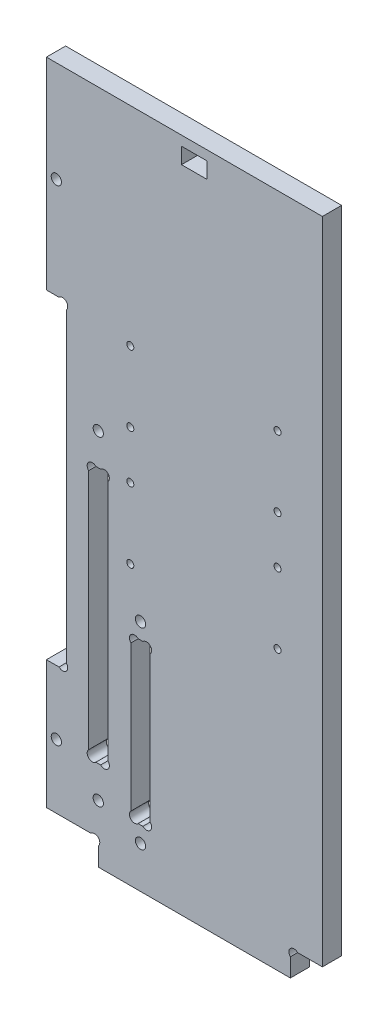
from build123d import *

# Parameters (mm, degrees)
ESQUISSE1_R      = 1.6
ESQUISSE1_R_2    = 1.1
ESQUISSE1_W      = 8
ESQUISSE1_H      = 5
EXTRUSION1_DEPTH = 6


with BuildPart() as part:
    # Esquisse1 → Extrusion1 (new body)
    with BuildSketch(Plane.XY):
        with BuildLine():
            Line((3.9372583, 50), (0, 50))
            Line((0, 50), (0, 10))
            Line((0, 10), (13.9372583, 10))
            ThreePointArc((13.9372583, 10), (16.2, 10), (16.2, 7.7372583))
            Line((16.2, 7.7372583), (16.2, 2))
            Line((16.2, 2), (76.2, 2))
            Line((76.2, 2), (76.2, 7.7372583))
            ThreePointArc((76.2, 7.7372583), (76.2, 10), (78.4627417, 10))
            Line((78.4627417, 10), (86.2, 10))
            Line((86.2, 10), (86.2, 213))
            Line((86.2, 213), (0, 213))
            Line((0, 213), (0, 150))
            Line((0, 150), (3.9372583, 150))
            ThreePointArc((3.9372583, 150), (6.2, 150), (6.2, 147.7372583))
            Line((6.2, 147.7372583), (6.2, 52.2627417))
            ThreePointArc((6.2, 52.2627417), (6.2, 50), (3.9372583, 50))
        make_face()
        with Locations((3.1, 30)):
            Circle(ESQUISSE1_R, mode=Mode.SUBTRACT)
        with Locations((3.1, 181.5)):
            Circle(ESQUISSE1_R, mode=Mode.SUBTRACT)
        with Locations((29.4, 15)):
            Circle(ESQUISSE1_R, mode=Mode.SUBTRACT)
        with Locations((16.2, 20)):
            Circle(ESQUISSE1_R, mode=Mode.SUBTRACT)
        with Locations(Location((29.4, 75, 0), (0, 0, 180))):
            Circle(ESQUISSE1_R, mode=Mode.SUBTRACT)
        with Locations(Location((16.2, 120, 0), (0, 0, 180))):
            Circle(ESQUISSE1_R, mode=Mode.SUBTRACT)
        with Locations((72.2, 148)):
            Circle(ESQUISSE1_R_2, mode=Mode.SUBTRACT)
        with Locations((72.2, 126)):
            Circle(ESQUISSE1_R_2, mode=Mode.SUBTRACT)
        with Locations((72.2, 111)):
            Circle(ESQUISSE1_R_2, mode=Mode.SUBTRACT)
        with Locations((72.2, 89)):
            Circle(ESQUISSE1_R_2, mode=Mode.SUBTRACT)
        with Locations(Location((26.2, 89, 0), (0, 0, 180))):
            Circle(ESQUISSE1_R_2, mode=Mode.SUBTRACT)
        with Locations(Location((26.2, 111, 0), (0, 0, 180))):
            Circle(ESQUISSE1_R_2, mode=Mode.SUBTRACT)
        with Locations(Location((26.2, 126, 0), (0, 0, 180))):
            Circle(ESQUISSE1_R_2, mode=Mode.SUBTRACT)
        with Locations(Location((26.2, 148, 0), (0, 0, 180))):
            Circle(ESQUISSE1_R_2, mode=Mode.SUBTRACT)
        with BuildLine():
            Line((15.4627417, 110), (16.9372583, 110))
            ThreePointArc((16.9372583, 110), (19.2, 110), (19.2, 107.7372583))
            Line((19.2, 107.7372583), (19.2, 32.2627417))
            ThreePointArc((19.2, 32.2627417), (19.2, 30), (16.9372583, 30))
            Line((16.9372583, 30), (15.4627417, 30))
            ThreePointArc((15.4627417, 30), (13.2, 30), (13.2, 32.2627417))
            Line((13.2, 32.2627417), (13.2, 107.7372583))
            ThreePointArc((13.2, 107.7372583), (13.2, 110), (15.4627417, 110))
        make_face(mode=Mode.SUBTRACT)
        with BuildLine():
            Line((28.6627417, 70), (30.1372583, 70))
            ThreePointArc((30.1372583, 70), (32.4, 70), (32.4, 67.7372583))
            Line((32.4, 67.7372583), (32.4, 22.2627417))
            ThreePointArc((32.4, 22.2627417), (32.4, 20), (30.1372583, 20))
            Line((30.1372583, 20), (28.6627417, 20))
            ThreePointArc((28.6627417, 20), (26.4, 20), (26.4, 22.2627417))
            Line((26.4, 22.2627417), (26.4, 67.7372583))
            ThreePointArc((26.4, 67.7372583), (26.4, 70), (28.6627417, 70))
        make_face(mode=Mode.SUBTRACT)
        with Locations((46.2, 207.5)):
            Rectangle(ESQUISSE1_W, ESQUISSE1_H, mode=Mode.SUBTRACT)
    extrude(amount=EXTRUSION1_DEPTH)


solid = part.part
